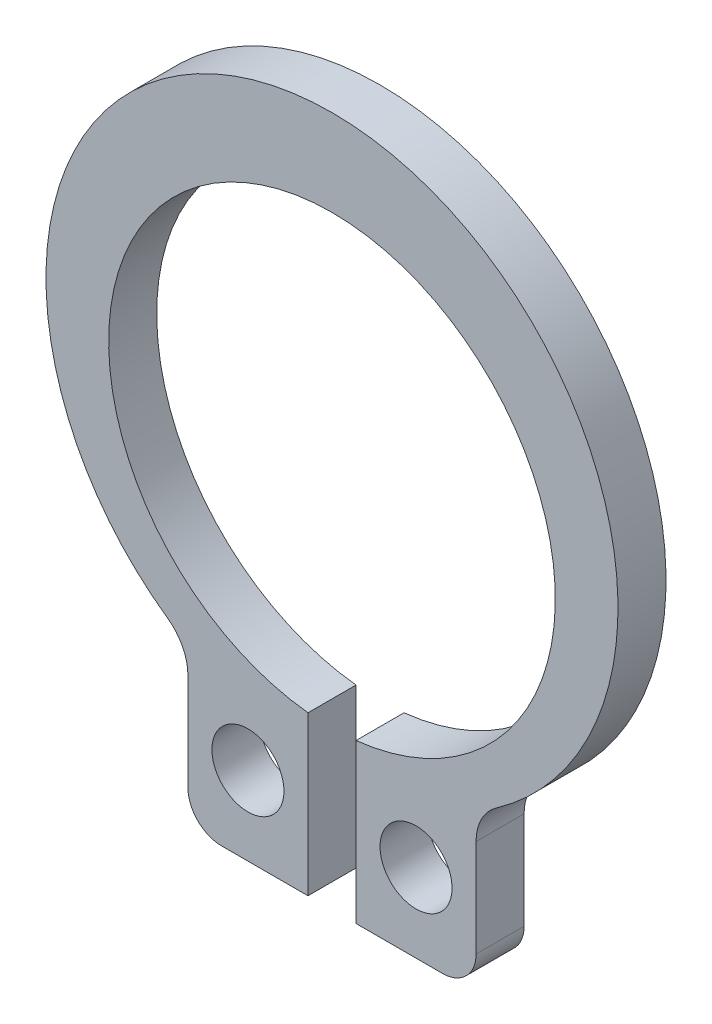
from build123d import *

# Parameters (mm, degrees)
BODYSKE_R      = 0.75
BASEBODY_DEPTH = 1
FILLET1_R      = 1
FILLET2_R      = 0.7


with BuildPart() as part:
    # BodySke → BaseBody (new body)
    with BuildSketch(Plane.XY):
        with BuildLine():
            Line((-0.5, -4.623040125), (-0.5, -7.923040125))
            Line((-0.5, -7.923040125), (-3, -7.923040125))
            Line((-3, -7.923040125), (-3, -4.64912529))
            ThreePointArc((-3, -4.64912529), (0, 6.45), (3, -4.64912529))
            Line((3, -4.64912529), (3, -7.923040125))
            Line((3, -7.923040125), (0.5, -7.923040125))
            Line((0.5, -7.923040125), (0.5, -4.623040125))
            ThreePointArc((0.5, -4.623040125), (0, 4.65), (-0.5, -4.623040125))
        make_face()
        with Locations((-1.75, -6.286082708)):
            Circle(BODYSKE_R, mode=Mode.SUBTRACT)
        with Locations(Location((1.75, -6.286082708, 0), (0, 0, 180))):
            Circle(BODYSKE_R, mode=Mode.SUBTRACT)
    extrude(amount=BASEBODY_DEPTH)

    # Fillet1
    fillet1_edges = [part.edges().sort_by_distance(p)[0] for p in [
        (-3, -4.64912529, 0.5),
        (3, -4.64912529, 0.5),
    ]]
    fillet(fillet1_edges, radius=FILLET1_R)

    # Fillet2
    fillet2_edges = [part.edges().sort_by_distance(p)[0] for p in [
        (-3, -7.923040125, 0.5),
        (3, -7.923040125, 0.5),
    ]]
    fillet(fillet2_edges, radius=FILLET2_R)


solid = part.part
